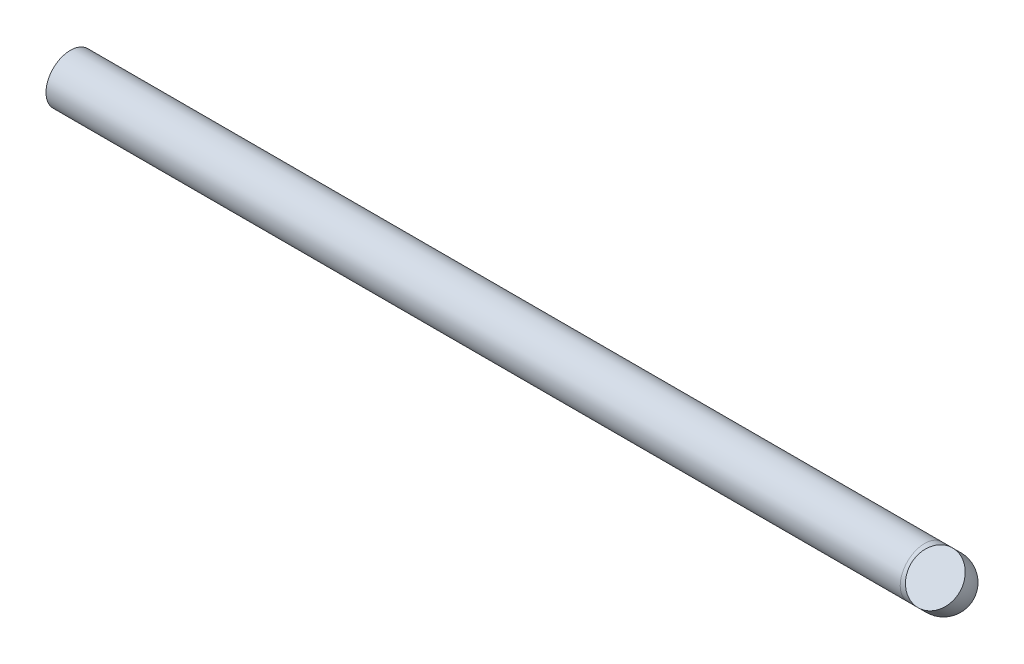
ISO-10303-21;
HEADER;
FILE_DESCRIPTION(('STEP AP214'),'2;1');
FILE_NAME('part.step','',(''),(''),'','','');
FILE_SCHEMA(('AUTOMOTIVE_DESIGN { 1 0 10303 214 1 1 1 1 }'));
ENDSEC;
DATA;
#1=APPLICATION_CONTEXT('core data for automotive mechanical design processes');
#2=APPLICATION_PROTOCOL_DEFINITION('international standard','automotive_design',2000,#1);
#3=PRODUCT_CONTEXT('',#1,'mechanical');
#4=PRODUCT('Part','Part','',(#3));
#5=PRODUCT_RELATED_PRODUCT_CATEGORY('part','',(#4));
#6=PRODUCT_DEFINITION_FORMATION('','',#4);
#7=PRODUCT_DEFINITION_CONTEXT('part definition',#1,'design');
#8=PRODUCT_DEFINITION('design','',#6,#7);
#9=PRODUCT_DEFINITION_SHAPE('','',#8);
#10=(LENGTH_UNIT() NAMED_UNIT(*) SI_UNIT(.MILLI.,.METRE.));
#11=(NAMED_UNIT(*) PLANE_ANGLE_UNIT() SI_UNIT($,.RADIAN.));
#12=(NAMED_UNIT(*) SI_UNIT($,.STERADIAN.) SOLID_ANGLE_UNIT());
#13=UNCERTAINTY_MEASURE_WITH_UNIT(LENGTH_MEASURE(1.E-05),#10,'distance_accuracy_value','');
#14=(GEOMETRIC_REPRESENTATION_CONTEXT(3) GLOBAL_UNCERTAINTY_ASSIGNED_CONTEXT((#13)) GLOBAL_UNIT_ASSIGNED_CONTEXT((#10,
#11,#12)) REPRESENTATION_CONTEXT('',''));
#15=CARTESIAN_POINT('',(0.,0.,0.));
#16=DIRECTION('',(0.,0.,1.));
#17=DIRECTION('',(1.,0.,0.));
#18=AXIS2_PLACEMENT_3D('',#15,#16,#17);
#19=CARTESIAN_POINT('',(-15.0000000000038,0.902727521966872,-47.7704876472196));
#20=DIRECTION('',(1.74532925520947E-06,0.707106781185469,0.707106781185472));
#21=DIRECTION('',(0.,-0.707106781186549,0.707106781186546));
#22=AXIS2_PLACEMENT_3D('',#19,#20,#21);
#23=PLANE('',#22);
#24=CARTESIAN_POINT('',(-14.5000000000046,-0.511486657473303,-46.3562747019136));
#25=CARTESIAN_POINT('',(-14.6123502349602,-0.511482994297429,-46.356278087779));
#26=CARTESIAN_POINT('',(-14.7247753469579,-0.504770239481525,-46.3629905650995));
#27=CARTESIAN_POINT('',(-14.9465214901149,-0.47808649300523,-46.3896737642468));
#28=CARTESIAN_POINT('',(-15.0558389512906,-0.458100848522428,-46.4096591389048));
#29=CARTESIAN_POINT('',(-15.2681386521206,-0.405440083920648,-46.462319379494));
#30=CARTESIAN_POINT('',(-15.3711235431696,-0.372770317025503,-46.4949888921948));
#31=CARTESIAN_POINT('',(-15.5678449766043,-0.295677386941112,-46.5720813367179));
#32=CARTESIAN_POINT('',(-15.6615839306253,-0.251257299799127,-46.616501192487));
#33=CARTESIAN_POINT('',(-15.8371873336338,-0.151921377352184,-46.7158366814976));
#34=CARTESIAN_POINT('',(-15.9190517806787,-0.097005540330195,-46.7707523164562));
#35=CARTESIAN_POINT('',(-16.0686018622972,0.0217815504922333,-46.8895390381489));
#36=CARTESIAN_POINT('',(-16.1362837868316,0.0856551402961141,-46.9534124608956));
#37=CARTESIAN_POINT('',(-16.2555439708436,0.220552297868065,-47.0883093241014));
#38=CARTESIAN_POINT('',(-16.307115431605,0.291578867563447,-47.1593357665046));
#39=CARTESIAN_POINT('',(-16.3926084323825,0.438695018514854,-47.3064517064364));
#40=CARTESIAN_POINT('',(-16.4265493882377,0.514778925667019,-47.3825355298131));
#41=CARTESIAN_POINT('',(-16.4674192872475,0.643191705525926,-47.5109482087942));
#42=CARTESIAN_POINT('',(-16.4796208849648,0.694712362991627,-47.562468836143));
#43=CARTESIAN_POINT('',(-16.4959128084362,0.798390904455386,-47.666147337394));
#44=CARTESIAN_POINT('',(-16.5000031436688,0.85054878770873,-47.7183052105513));
#45=CARTESIAN_POINT('',(-16.4999952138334,0.982173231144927,-47.849929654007));
#46=CARTESIAN_POINT('',(-16.4905019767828,1.06166971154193,-47.9294261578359));
#47=CARTESIAN_POINT('',(-16.4527657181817,1.21846776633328,-48.0862243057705));
#48=CARTESIAN_POINT('',(-16.4245020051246,1.29576682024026,-48.1635234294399));
#49=CARTESIAN_POINT('',(-16.3500294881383,1.44588393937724,-48.313640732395));
#50=CARTESIAN_POINT('',(-16.3038285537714,1.51870395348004,-48.3864608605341));
#51=CARTESIAN_POINT('',(-16.1948037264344,1.65780708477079,-48.5255642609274));
#52=CARTESIAN_POINT('',(-16.1319836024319,1.72409167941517,-48.5918490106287));
#53=CARTESIAN_POINT('',(-15.9914920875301,1.84827000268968,-48.7160276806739));
#54=CARTESIAN_POINT('',(-15.9138192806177,1.90616293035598,-48.7739208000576));
#55=CARTESIAN_POINT('',(-15.7458279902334,2.01190822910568,-48.8796665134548));
#56=CARTESIAN_POINT('',(-15.6555090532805,2.0597602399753,-48.9275187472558));
#57=CARTESIAN_POINT('',(-15.4647931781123,2.14406213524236,-49.0118211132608));
#58=CARTESIAN_POINT('',(-15.3643964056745,2.18051220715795,-49.0482714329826));
#59=CARTESIAN_POINT('',(-15.1563739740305,2.24097649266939,-49.1087362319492));
#60=CARTESIAN_POINT('',(-15.0487483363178,2.2649907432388,-49.1327507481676));
#61=CARTESIAN_POINT('',(-14.8293226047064,2.29990172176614,-49.1676622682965));
#62=CARTESIAN_POINT('',(-14.7175225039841,2.31079842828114,-49.1785592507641));
#63=CARTESIAN_POINT('',(-14.492922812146,2.31916557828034,-49.1869269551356));
#64=CARTESIAN_POINT('',(-14.3801232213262,2.31663602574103,-49.184397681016));
#65=CARTESIAN_POINT('',(-14.1567230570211,2.29822005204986,-49.1659822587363));
#66=CARTESIAN_POINT('',(-14.0461224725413,2.2823336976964,-49.1500961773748));
#67=CARTESIAN_POINT('',(-13.8302734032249,2.23766415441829,-49.1054271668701));
#68=CARTESIAN_POINT('',(-13.7250249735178,2.20888083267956,-49.0766441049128));
#69=CARTESIAN_POINT('',(-13.5228086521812,2.13919868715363,-49.006962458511));
#70=CARTESIAN_POINT('',(-13.4258410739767,2.09829940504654,-48.9660634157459));
#71=CARTESIAN_POINT('',(-13.2888120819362,2.02882381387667,-48.8965881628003));
#72=CARTESIAN_POINT('',(-13.2445330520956,2.00430625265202,-48.8720707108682));
#73=CARTESIAN_POINT('',(-13.1590046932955,1.95270004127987,-48.820464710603));
#74=CARTESIAN_POINT('',(-13.1177583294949,1.92560893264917,-48.7933737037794));
#75=CARTESIAN_POINT('',(-12.9991452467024,1.84082177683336,-48.7085868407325));
#76=CARTESIAN_POINT('',(-12.926783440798,1.77955037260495,-48.6473156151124));
#77=CARTESIAN_POINT('',(-12.7976583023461,1.64927829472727,-48.5170438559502));
#78=CARTESIAN_POINT('',(-12.7408943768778,1.5802779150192,-48.4480436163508));
#79=CARTESIAN_POINT('',(-12.6686236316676,1.47248067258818,-48.3402465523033));
#80=CARTESIAN_POINT('',(-12.6466607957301,1.43578589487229,-48.3035518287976));
#81=CARTESIAN_POINT('',(-12.6072001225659,1.36123829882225,-48.2290043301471));
#82=CARTESIAN_POINT('',(-12.5896986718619,1.32338644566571,-48.1911525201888));
#83=CARTESIAN_POINT('',(-12.5592968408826,1.24683853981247,-48.1146046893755));
#84=CARTESIAN_POINT('',(-12.546389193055,1.20814392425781,-48.0759101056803));
#85=CARTESIAN_POINT('',(-12.5252277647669,1.1301308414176,-47.9978970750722));
#86=CARTESIAN_POINT('',(-12.5169726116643,1.0908125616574,-47.958578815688));
#87=CARTESIAN_POINT('',(-12.5073841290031,1.02664853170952,-47.894414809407));
#88=CARTESIAN_POINT('',(-12.5046159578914,1.0019055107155,-47.8696717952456));
#89=CARTESIAN_POINT('',(-12.5009237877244,0.952350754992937,-47.8201170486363));
#90=CARTESIAN_POINT('',(-12.499999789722,0.927539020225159,-47.7953053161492));
#91=CARTESIAN_POINT('',(-12.5000003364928,0.863017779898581,-47.7307840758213));
#92=CARTESIAN_POINT('',(-12.5023670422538,0.823303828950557,-47.6910701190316));
#93=CARTESIAN_POINT('',(-12.5118184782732,0.744150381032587,-47.6119166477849));
#94=CARTESIAN_POINT('',(-12.5189046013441,0.704710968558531,-47.5724772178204));
#95=CARTESIAN_POINT('',(-12.5377630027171,0.626328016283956,-47.4940942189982));
#96=CARTESIAN_POINT('',(-12.5495427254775,0.587385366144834,-47.4551515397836));
#97=CARTESIAN_POINT('',(-12.5777071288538,0.510318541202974,-47.3780846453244));
#98=CARTESIAN_POINT('',(-12.5940955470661,0.472195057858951,-47.3399611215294));
#99=CARTESIAN_POINT('',(-12.6499472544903,0.359624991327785,-47.2273909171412));
#100=CARTESIAN_POINT('',(-12.6961428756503,0.286789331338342,-47.1545551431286));
#101=CARTESIAN_POINT('',(-12.8051960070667,0.147644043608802,-47.0154095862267));
#102=CARTESIAN_POINT('',(-12.8680541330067,0.0813346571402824,-46.9491000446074));
#103=CARTESIAN_POINT('',(-12.9734031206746,-0.011790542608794,-46.8559745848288));
#104=CARTESIAN_POINT('',(-13.0103884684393,-0.0417918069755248,-46.8259732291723));
#105=CARTESIAN_POINT('',(-13.0877725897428,-0.099464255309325,-46.7683005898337));
#106=CARTESIAN_POINT('',(-13.1281680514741,-0.127137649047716,-46.7406270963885));
#107=CARTESIAN_POINT('',(-13.2121407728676,-0.179998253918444,-46.6877662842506));
#108=CARTESIAN_POINT('',(-13.2557201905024,-0.205183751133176,-46.6625806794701));
#109=CARTESIAN_POINT('',(-13.3457212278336,-0.252871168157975,-46.6148930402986));
#110=CARTESIAN_POINT('',(-13.3921434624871,-0.275372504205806,-46.5923915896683));
#111=CARTESIAN_POINT('',(-13.5352050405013,-0.338602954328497,-46.5291607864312));
#112=CARTESIAN_POINT('',(-13.6356901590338,-0.375090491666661,-46.4926730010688));
#113=CARTESIAN_POINT('',(-13.843771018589,-0.43555788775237,-46.4322050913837));
#114=CARTESIAN_POINT('',(-13.9513587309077,-0.459551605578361,-46.4082111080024));
#115=CARTESIAN_POINT('',(-14.1329563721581,-0.488447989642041,-46.379314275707));
#116=CARTESIAN_POINT('',(-14.2058189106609,-0.497076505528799,-46.370685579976));
#117=CARTESIAN_POINT('',(-14.3524435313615,-0.508597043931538,-46.3591646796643));
#118=CARTESIAN_POINT('',(-14.4262056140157,-0.511489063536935,-46.3562724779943));
#119=CARTESIAN_POINT('',(-14.5000000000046,-0.511486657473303,-46.3562747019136));
#120=B_SPLINE_CURVE_WITH_KNOTS('',3,(#24,#25,#26,#27,#28,#29,#30,#31,#32,#33,#34,#35,#36,#37,
#38,#39,#40,#41,#42,#43,#44,#45,#46,#47,#48,#49,#50,#51,#52,#53,#54,#55,#56,#57,#58,#59,#60,#61,
#62,#63,#64,#65,#66,#67,#68,#69,#70,#71,#72,#73,#74,#75,#76,#77,#78,#79,#80,#81,#82,#83,#84,#85,
#86,#87,#88,#89,#90,#91,#92,#93,#94,#95,#96,#97,#98,#99,#100,#101,#102,#103,#104,#105,#106,#107,
#108,#109,#110,#111,#112,#113,#114,#115,#116,#117,#118,#119),.UNSPECIFIED.,.T.,.F.,(4,2,2,2,2,2,
2,2,2,2,2,2,2,2,2,2,2,2,2,2,2,2,2,2,2,2,2,2,2,2,2,2,2,2,2,2,2,2,2,2,2,2,2,2,2,2,2,4),(0.,
0.336782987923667,0.673938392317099,1.01095165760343,1.34787678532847,1.6848019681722,
2.02181517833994,2.35897041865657,2.69575357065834,2.91696095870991,3.13816808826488,
3.47495135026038,3.81210648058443,4.1491138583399,4.48604487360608,4.82300802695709,
5.15998326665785,5.49695296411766,5.83392165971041,6.17089090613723,6.50786005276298,
6.84482751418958,7.18179844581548,7.51878212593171,7.68732806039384,7.85603665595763,
8.19301225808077,8.52997504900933,8.69885900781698,8.86760574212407,9.03608431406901,
9.20451315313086,9.3097722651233,9.4150314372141,9.58346020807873,9.75193870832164,
9.92068550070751,10.0895695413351,10.426532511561,10.7635079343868,10.932197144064,
11.1007243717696,11.2693669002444,11.4380460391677,11.7752026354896,12.1119844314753,
12.3331916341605,12.5543989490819),.UNSPECIFIED.);
#121=CARTESIAN_POINT('',(-14.5000000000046,-0.511486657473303,-46.3562747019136));
#122=VERTEX_POINT('',#121);
#123=EDGE_CURVE('E18',#122,#122,#120,.T.);
#124=ORIENTED_EDGE('',*,*,#123,.F.);
#125=EDGE_LOOP('',(#124));
#126=FACE_BOUND('',#125,.T.);
#127=ADVANCED_FACE('F14',(#126),#23,.T.);
#128=CARTESIAN_POINT('',(-87.5,-0.511482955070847,-49.1846981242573));
#129=DIRECTION('',(-1.,0.,0.));
#130=DIRECTION('',(0.,0.,1.));
#131=AXIS2_PLACEMENT_3D('',#128,#129,#130);
#132=PLANE('',#131);
#133=CARTESIAN_POINT('',(-87.5,-1.21858973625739,-49.8918049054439));
#134=DIRECTION('',(-1.,0.,0.));
#135=DIRECTION('',(0.,0.,1.));
#136=AXIS2_PLACEMENT_3D('',#133,#134,#135);
#137=CIRCLE('',#136,2.);
#138=CARTESIAN_POINT('',(-87.5,-1.21858973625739,-47.8918049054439));
#139=VERTEX_POINT('',#138);
#140=EDGE_CURVE('E25',#139,#139,#137,.F.);
#141=ORIENTED_EDGE('',*,*,#140,.F.);
#142=EDGE_LOOP('',(#141));
#143=FACE_BOUND('',#142,.T.);
#144=ADVANCED_FACE('F36',(#143),#132,.T.);
#145=CARTESIAN_POINT('',(-17.5,0.902730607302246,-47.7704845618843));
#146=DIRECTION('',(0.,-0.707106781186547,0.707106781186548));
#147=DIRECTION('',(0.,-0.707106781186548,-0.707106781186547));
#148=AXIS2_PLACEMENT_3D('',#145,#146,#147);
#149=TOROIDAL_SURFACE('',#148,2.99999999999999,2.);
#150=ORIENTED_EDGE('',*,*,#123,.T.);
#151=EDGE_LOOP('',(#150));
#152=FACE_BOUND('',#151,.T.);
#153=CARTESIAN_POINT('',(-17.5,-1.21858973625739,-49.8918049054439));
#154=DIRECTION('',(-1.,0.,0.));
#155=DIRECTION('',(0.,0.707106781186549,0.707106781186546));
#156=AXIS2_PLACEMENT_3D('',#153,#154,#155);
#157=CIRCLE('',#156,2.);
#158=CARTESIAN_POINT('',(-17.5,0.195623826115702,-48.4775913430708));
#159=VERTEX_POINT('',#158);
#160=EDGE_CURVE('E9',#159,#159,#157,.T.);
#161=ORIENTED_EDGE('',*,*,#160,.F.);
#162=EDGE_LOOP('',(#161));
#163=FACE_BOUND('',#162,.T.);
#164=ADVANCED_FACE('F32',(#152,#163),#149,.T.);
#165=CARTESIAN_POINT('',(-17.5,-1.21858973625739,-49.8918049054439));
#166=DIRECTION('',(-1.,0.,0.));
#167=DIRECTION('',(0.,0.,1.));
#168=AXIS2_PLACEMENT_3D('',#165,#166,#167);
#169=CYLINDRICAL_SURFACE('',#168,2.);
#170=ORIENTED_EDGE('',*,*,#140,.T.);
#171=EDGE_LOOP('',(#170));
#172=FACE_BOUND('',#171,.T.);
#173=ORIENTED_EDGE('',*,*,#160,.T.);
#174=EDGE_LOOP('',(#173));
#175=FACE_BOUND('',#174,.T.);
#176=ADVANCED_FACE('F16',(#172,#175),#169,.T.);
#177=CLOSED_SHELL('',(#127,#144,#164,#176));
#178=MANIFOLD_SOLID_BREP('B1',#177);
#179=ADVANCED_BREP_SHAPE_REPRESENTATION('',(#18,#178),#14);
#180=SHAPE_DEFINITION_REPRESENTATION(#9,#179);
ENDSEC;
END-ISO-10303-21;
